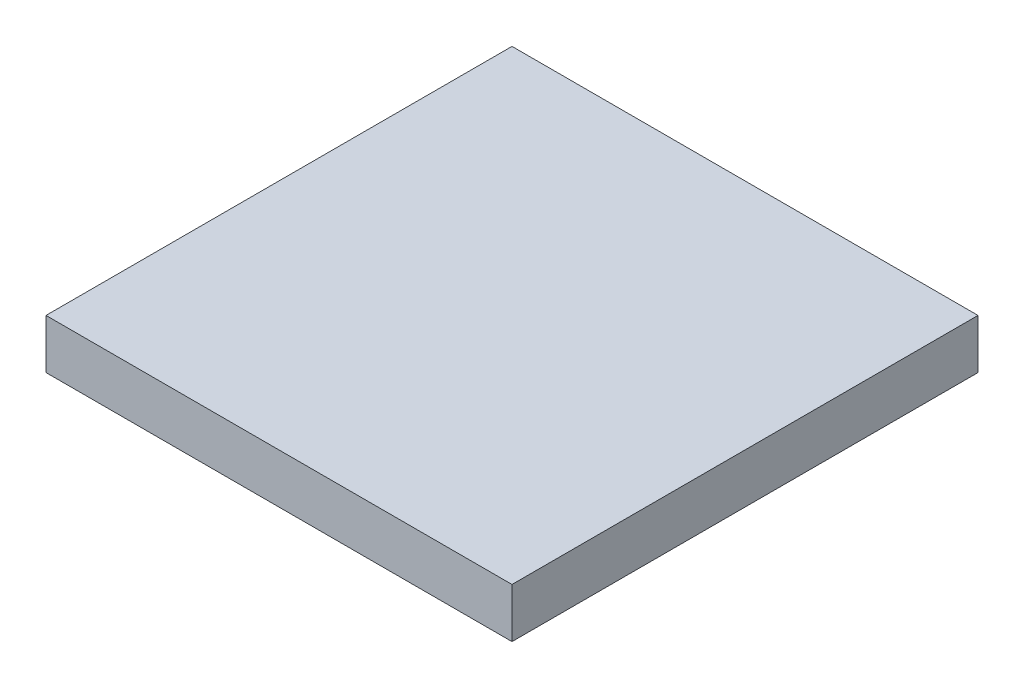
from build123d import *

# Parameters (mm, degrees)
SKETCH1_W           = 8
SKETCH1_H           = 8
BOSS_EXTRUDE1_DEPTH = 0.85


with BuildPart() as part:
    # Sketch1 → Boss-Extrude1 (new body)
    with BuildSketch(Plane(origin=(0, 0, 0), x_dir=(1, 0, 0), z_dir=(0, 1, 0))):
        with Locations((4, 4)):
            Rectangle(SKETCH1_W, SKETCH1_H)
    extrude(amount=BOSS_EXTRUDE1_DEPTH)


solid = part.part
